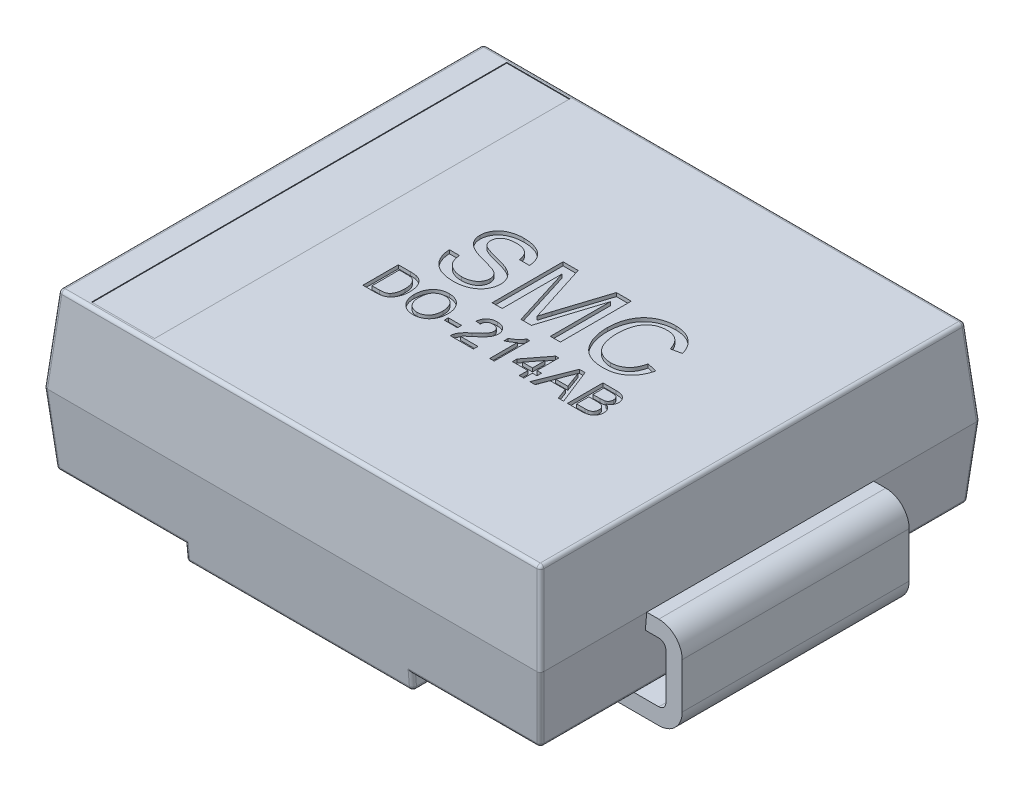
from build123d import *

# Parameters (mm, degrees)
BOSS_EXTRUDE1_START = 1.3
SKETCH1_W           = 7
SKETCH1_H           = 6.2
BOSS_EXTRUDE1_DEPTH = 1.2
BOSS_EXTRUDE1_TAPER = 5
BOSS_EXTRUDE2_START = 1.3
SKETCH1_2_W         = 7
SKETCH1_2_H         = 6.2
BOSS_EXTRUDE2_DEPTH = 1.23
BOSS_EXTRUDE2_DRAFT = -5
CUT_EXTRUDE2_DEPTH  = 4
BOSS_EXTRUDE3_DEPTH = 1.6
FILLET1_R           = 0.05
SKETCH5_W           = 0.890323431
SKETCH5_H           = 5.855004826
CUT_EXTRUDE4_DEPTH  = 0.01
SKETCH4_W           = 0.185897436
SKETCH4_H           = 0.057692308
CUT_EXTRUDE3_DEPTH  = 0.05


with BuildPart() as part:
    # Sketch1 → Boss-Extrude1 (new body)
    with BuildSketch(Plane(origin=(0, 0, 0), x_dir=(1, 0, 0), z_dir=(0, 1, 0)).offset(BOSS_EXTRUDE1_START)):
        Rectangle(SKETCH1_W, SKETCH1_H)
    extrude(amount=BOSS_EXTRUDE1_DEPTH, taper=BOSS_EXTRUDE1_TAPER)


with BuildPart() as boss_extrude2_tool:
    # Sketch1_2 → Boss-Extrude2 (with draft: the straight prism first)
    with BuildSketch(Plane(origin=(0, 0, 0), x_dir=(1, 0, 0), z_dir=(0, 1, 0)).offset(BOSS_EXTRUDE2_START)):
        Rectangle(SKETCH1_2_W, SKETCH1_2_H)
    extrude(amount=-BOSS_EXTRUDE2_DEPTH)
    # Boss-Extrude2: the draft: its side faces are tilted about the plane it starts from
    boss_extrude2_sides = [boss_extrude2_tool.faces().sort_by_distance(p)[0] for p in [
        (0, 0.685, 3.1),
        (3.5, 0.685, 0),
        (0, 0.685, -3.1),
        (-3.5, 0.685, 0),
    ]]
    draft(boss_extrude2_sides, Plane(origin=(0, 0, 0), x_dir=(1, 0, 0), z_dir=(0, 1, 0)).offset(BOSS_EXTRUDE2_START), BOSS_EXTRUDE2_DRAFT)


with BuildPart() as part_1:
    add(part.part)

    # Boss-Extrude2: add boss_extrude2_tool
    add(boss_extrude2_tool.part)

    # Sketch3 → Cut-Extrude2 (cut, symmetric)
    with BuildSketch(Plane.XY):
        Polygon((1.6, 0), (-1.6, 0), (-1.6, 0.297017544), (-3.60877193, 0.297017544), (-3.60877193, -0.205171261), (3.60877193, -0.205171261), (3.60877193, 0.297017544), (1.6, 0.297017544), align=None)
    extrude(amount=CUT_EXTRUDE2_DEPTH, both=True, mode=Mode.SUBTRACT)

    # Sketch2 → Boss-Extrude3 (add, symmetric)
    with BuildSketch(Plane.XY):
        with BuildLine():
            Line((3.67, 1.3), (-3.67, 1.3))
            ThreePointArc((-3.67, 1.3), (-3.903345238, 1.203345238), (-4, 0.97))
            Line((-4, 0.97), (-4, 0.33))
            ThreePointArc((-4, 0.33), (-3.903345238, 0.096654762), (-3.67, 0))
            Line((-3.67, 0), (-2.5, 0))
            Line((-2.5, 0), (-2.5, 0.23))
            Line((-2.5, 0.23), (-3.67, 0.23))
            ThreePointArc((-3.67, 0.23), (-3.740710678, 0.259289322), (-3.77, 0.33))
            Line((-3.77, 0.33), (-3.77, 0.97))
            ThreePointArc((-3.77, 0.97), (-3.740710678, 1.040710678), (-3.67, 1.07))
            Line((-3.67, 1.07), (3.67, 1.07))
            ThreePointArc((3.67, 1.07), (3.740710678, 1.040710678), (3.77, 0.97))
            Line((3.77, 0.97), (3.77, 0.33))
            ThreePointArc((3.77, 0.33), (3.740710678, 0.259289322), (3.67, 0.23))
            Line((3.67, 0.23), (2.5, 0.23))
            Line((2.5, 0.23), (2.5, 0))
            Line((2.5, 0), (3.67, 0))
            ThreePointArc((3.67, 0), (3.903345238, 0.096654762), (4, 0.33))
            Line((4, 0.33), (4, 0.97))
            ThreePointArc((4, 0.97), (3.903345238, 1.203345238), (3.67, 1.3))
        make_face()
    extrude(amount=BOSS_EXTRUDE3_DEPTH, both=True)

    # Fillet1
    fillet1_edges = [part_1.edges().sort_by_distance(p)[0] for p in [
        (-3.395013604, 2.5, 0),
        (0, 2.5, 2.995013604),
        (0, 0.07, 2.992388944),
        (0, 0.07, -2.992388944),
        (1.6, 0.07, 0),
        (-1.6, 0.07, 0),
        (3.456125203, 0.798508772, -3.056125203),
        (-3.456125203, 0.798508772, -3.056125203),
        (-2.506125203, 0.297017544, -3.012250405),
        (2.506125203, 0.297017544, -3.012250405),
        (-3.456125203, 0.798508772, 3.056125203),
        (3.456125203, 0.798508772, 3.056125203),
        (3.412250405, 0.297017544, 0),
        (2.506125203, 0.297017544, 3.012250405),
        (-2.506125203, 0.297017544, 3.012250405),
        (-3.412250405, 0.297017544, 0),
        (-1.6, 0.183508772, 3.002319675),
        (-1.6, 0.183508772, -3.002319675),
        (1.6, 0.183508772, 3.002319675),
        (1.6, 0.183508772, -3.002319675),
        (3.395013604, 2.5, 0),
        (0, 2.5, -2.995013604),
        (3.447506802, 1.9, 3.047506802),
        (-3.447506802, 1.9, 3.047506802),
        (-3.447506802, 1.9, -3.047506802),
        (3.447506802, 1.9, -3.047506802),
    ]]
    fillet(fillet1_edges, radius=FILLET1_R)

    # Sketch5 → Cut-Extrude4 (cut)
    with BuildSketch(Plane(origin=(0, 2.5, 0), x_dir=(1, 0, 0), z_dir=(0, 1, 0))):
        with Locations((-2.556330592, 0)):
            Rectangle(SKETCH5_W, SKETCH5_H)
    extrude(amount=-CUT_EXTRUDE4_DEPTH, mode=Mode.SUBTRACT)

    # Sketch4 → Cut-Extrude3 (cut)
    # profile 1 of 11: a face of its own
    with BuildSketch(Plane(origin=(0, 2.5, 0), x_dir=(1, 0, 0), z_dir=(0, 1, 0))):
        with BuildLine():
            Line((-1.117518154, 0.235376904), (-0.976492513, 0.235376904))
            add(Edge.make_bspline(
                [(-0.976492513, 0.235376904), (-0.974941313, 0.22271474), (-0.971961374, 0.198390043), (-0.963629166, 0.163913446), (-0.952905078, 0.132915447), (-0.939543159, 0.104984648), (-0.921966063, 0.080455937), (-0.900788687, 0.058331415), (-0.875069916, 0.039172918), (-0.846039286, 0.022123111), (-0.813707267, 0.008736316), (-0.779189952, -0.001187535), (-0.74265196, -0.007067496), (-0.717632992, -0.007825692), (-0.704857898, -0.00821284)],
                knots=[0, 0, 0, 0, 1.125557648, 2.162256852, 3.1243583, 4.018160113, 4.88511607, 5.777380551, 6.711250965, 7.707237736, 8.743031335, 9.791730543, 10.872421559, 12, 12, 12, 12], degree=3))
            add(Edge.make_bspline(
                [(-0.704857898, -0.00821284), (-0.69355304, -0.008003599), (-0.671510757, -0.00759562), (-0.63962413, -0.002694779), (-0.609618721, 0.004256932), (-0.582052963, 0.014772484), (-0.557028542, 0.02754166), (-0.535297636, 0.042986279), (-0.516744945, 0.060403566), (-0.502216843, 0.080252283), (-0.490803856, 0.101050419), (-0.48243125, 0.122428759), (-0.47744386, 0.144268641), (-0.476808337, 0.15896364), (-0.476492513, 0.166266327)],
                knots=[0, 0, 0, 0, 1.267006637, 2.470417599, 3.611360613, 4.716023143, 5.771382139, 6.754486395, 7.697536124, 8.612899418, 9.501261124, 10.352596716, 11.181322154, 12, 12, 12, 12], degree=3))
            add(Edge.make_bspline(
                [(-0.476492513, 0.166266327), (-0.476830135, 0.173495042), (-0.477490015, 0.187623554), (-0.481790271, 0.208192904), (-0.489963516, 0.227019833), (-0.500569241, 0.24487277), (-0.515323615, 0.261195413), (-0.533964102, 0.276235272), (-0.556901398, 0.289870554), (-0.574020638, 0.29733803), (-0.583063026, 0.301282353)],
                knots=[0, 0, 0, 0, 0.942140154, 1.841411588, 2.718743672, 3.605002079, 4.535543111, 5.568170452, 6.715506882, 8, 8, 8, 8], degree=3))
            add(Edge.make_bspline(
                [(-0.583063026, 0.301282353), (-0.586586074, 0.302728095), (-0.59454528, 0.305994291), (-0.608186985, 0.310318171), (-0.624374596, 0.315909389), (-0.643497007, 0.321667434), (-0.665451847, 0.327758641), (-0.690202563, 0.334652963), (-0.717735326, 0.341984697), (-0.747269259, 0.349788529), (-0.777089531, 0.35772383), (-0.805579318, 0.365666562), (-0.831791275, 0.373729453), (-0.855940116, 0.381492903), (-0.877901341, 0.389288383), (-0.897737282, 0.396902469), (-0.915472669, 0.404180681), (-0.926304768, 0.409532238), (-0.931420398, 0.412059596)],
                knots=[0, 0, 0, 0, 0.499201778, 1.127787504, 1.87543728, 2.745208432, 3.745951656, 4.863402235, 6.114490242, 7.482339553, 8.869366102, 10.161191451, 11.360587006, 12.46547846, 13.487450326, 14.41601931, 15.251940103, 16, 16, 16, 16], degree=3))
            add(Edge.make_bspline(
                [(-0.931420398, 0.412059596), (-0.943190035, 0.418417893), (-0.965908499, 0.430691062), (-0.996485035, 0.452635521), (-1.02224887, 0.476986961), (-1.043091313, 0.503710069), (-1.059424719, 0.532352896), (-1.070444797, 0.562964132), (-1.077992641, 0.594988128), (-1.078698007, 0.617009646), (-1.079056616, 0.628205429)],
                knots=[0, 0, 0, 0, 1.158441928, 2.236094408, 3.251151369, 4.220012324, 5.163146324, 6.095083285, 7.031536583, 8, 8, 8, 8], degree=3))
            add(Edge.make_bspline(
                [(-1.079056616, 0.628205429), (-1.07858067, 0.640602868), (-1.077634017, 0.665261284), (-1.069236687, 0.701445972), (-1.055842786, 0.736265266), (-1.040596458, 0.763908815), (-1.025727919, 0.784812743), (-1.013401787, 0.79986737), (-0.99957562, 0.813783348), (-0.984675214, 0.826754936), (-0.968434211, 0.838588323), (-0.951255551, 0.849769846), (-0.932517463, 0.859380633), (-0.906187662, 0.871612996), (-0.870964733, 0.883828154), (-0.826623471, 0.894472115), (-0.779955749, 0.900740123), (-0.748145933, 0.901602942), (-0.731901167, 0.90204357)],
                knots=[0, 0, 0, 0, 1.199927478, 2.386647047, 3.578628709, 4.806592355, 5.433127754, 6.062729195, 6.689531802, 7.331674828, 7.974827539, 8.635320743, 9.315455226, 10.01318112, 11.447700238, 12.918145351, 14.426146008, 16, 16, 16, 16], degree=3))
            add(Edge.make_bspline(
                [(-0.731901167, 0.90204357), (-0.714120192, 0.901636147), (-0.679497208, 0.900842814), (-0.629189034, 0.894242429), (-0.58226528, 0.882907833), (-0.545466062, 0.870219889), (-0.51826083, 0.857375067), (-0.498933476, 0.847352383), (-0.480993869, 0.835764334), (-0.464280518, 0.823224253), (-0.448638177, 0.809737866), (-0.43446889, 0.794984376), (-0.421157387, 0.779467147), (-0.405514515, 0.757189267), (-0.388648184, 0.727704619), (-0.374064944, 0.689506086), (-0.364046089, 0.649190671), (-0.362097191, 0.621319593), (-0.361107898, 0.607171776)],
                knots=[0, 0, 0, 0, 1.607600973, 3.130308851, 4.577334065, 5.967726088, 6.640410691, 7.296826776, 7.935019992, 8.569057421, 9.185393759, 9.8003086, 10.417295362, 11.032210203, 12.259799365, 13.477607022, 14.719591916, 16, 16, 16, 16], degree=3))
            Line((-0.361107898, 0.607171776), (-0.502133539, 0.607171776))
            add(Edge.make_bspline(
                [(-0.502133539, 0.607171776), (-0.503029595, 0.614332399), (-0.504782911, 0.628343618), (-0.509132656, 0.648626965), (-0.515230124, 0.667465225), (-0.522372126, 0.685034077), (-0.531029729, 0.701150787), (-0.541121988, 0.715970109), (-0.552771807, 0.729317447), (-0.565679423, 0.741545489), (-0.580237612, 0.7521927), (-0.59637157, 0.761434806), (-0.614108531, 0.769242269), (-0.63343287, 0.775636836), (-0.654348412, 0.780594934), (-0.67690273, 0.784242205), (-0.701087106, 0.786110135), (-0.717742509, 0.786472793), (-0.726292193, 0.786658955)],
                knots=[0, 0, 0, 0, 1.074487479, 2.102453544, 3.083708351, 4.020042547, 4.923259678, 5.803182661, 6.684453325, 7.556870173, 8.445961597, 9.363679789, 10.320905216, 11.327237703, 12.390948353, 13.519046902, 14.726457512, 16, 16, 16, 16], degree=3))
            add(Edge.make_bspline(
                [(-0.726292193, 0.786658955), (-0.73517919, 0.786591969), (-0.752382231, 0.786462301), (-0.777251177, 0.784098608), (-0.800301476, 0.780855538), (-0.821493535, 0.776071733), (-0.840757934, 0.769809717), (-0.858380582, 0.762578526), (-0.873868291, 0.753414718), (-0.887582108, 0.743207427), (-0.899412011, 0.731913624), (-0.909607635, 0.720012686), (-0.918624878, 0.707854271), (-0.925631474, 0.694773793), (-0.931335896, 0.681266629), (-0.935015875, 0.667078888), (-0.937621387, 0.652473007), (-0.937892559, 0.642507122), (-0.938030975, 0.637420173)],
                knots=[0, 0, 0, 0, 1.464176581, 2.834285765, 4.113735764, 5.29917439, 6.409476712, 7.449999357, 8.431575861, 9.367089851, 10.262376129, 11.120706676, 11.948504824, 12.751342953, 13.560717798, 14.359016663, 15.162382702, 16, 16, 16, 16], degree=3))
            add(Edge.make_bspline(
                [(-0.938030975, 0.637420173), (-0.937666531, 0.628816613), (-0.93695918, 0.612117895), (-0.929736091, 0.588394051), (-0.918626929, 0.56676823), (-0.907682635, 0.555001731), (-0.902173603, 0.549078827)],
                knots=[0, 0, 0, 0, 1.050964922, 2.039826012, 3.013306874, 4, 4, 4, 4], degree=3))
            add(Edge.make_bspline(
                [(-0.902173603, 0.549078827), (-0.898700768, 0.546118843), (-0.891020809, 0.53957302), (-0.87673106, 0.53091039), (-0.859013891, 0.522157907), (-0.837750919, 0.513457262), (-0.812978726, 0.504702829), (-0.784737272, 0.495689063), (-0.752918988, 0.486736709), (-0.718493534, 0.478109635), (-0.683715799, 0.469447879), (-0.650665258, 0.460819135), (-0.620319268, 0.452641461), (-0.592725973, 0.444665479), (-0.567856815, 0.436913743), (-0.545798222, 0.429223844), (-0.526371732, 0.422151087), (-0.514470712, 0.417174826), (-0.508944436, 0.414864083)],
                knots=[0, 0, 0, 0, 0.523891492, 1.158553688, 1.913783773, 2.794766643, 3.797521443, 4.933638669, 6.202080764, 7.596537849, 9.013317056, 10.322179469, 11.523240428, 12.626146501, 13.623953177, 14.517289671, 15.311498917, 16, 16, 16, 16], degree=3))
            add(Edge.make_bspline(
                [(-0.508944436, 0.414864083), (-0.501754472, 0.411549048), (-0.487641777, 0.405042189), (-0.467649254, 0.393932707), (-0.448994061, 0.382396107), (-0.43182692, 0.370121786), (-0.41620334, 0.357083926), (-0.401948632, 0.34343191), (-0.388976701, 0.329242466), (-0.377810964, 0.31406145), (-0.367785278, 0.298502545), (-0.359012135, 0.282348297), (-0.351948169, 0.265503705), (-0.34575263, 0.248171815), (-0.341296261, 0.230159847), (-0.337801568, 0.211649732), (-0.335763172, 0.192554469), (-0.335566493, 0.179625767), (-0.335466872, 0.173077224)],
                knots=[0, 0, 0, 0, 1.198900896, 2.353241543, 3.461831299, 4.520043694, 5.547003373, 6.541368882, 7.508191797, 8.454912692, 9.392021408, 10.310662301, 11.235020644, 12.156274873, 13.095836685, 14.042125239, 15.00831306, 16, 16, 16, 16], degree=3))
            add(Edge.make_bspline(
                [(-0.335466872, 0.173077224), (-0.335988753, 0.160008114), (-0.337024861, 0.134061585), (-0.345946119, 0.095815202), (-0.359960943, 0.058754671), (-0.376396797, 0.029345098), (-0.391933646, 0.006880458), (-0.404985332, -0.009266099), (-0.419458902, -0.024196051), (-0.43499803, -0.038377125), (-0.451723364, -0.051519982), (-0.469775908, -0.063629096), (-0.488965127, -0.074830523), (-0.516366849, -0.088480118), (-0.552760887, -0.10275889), (-0.599119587, -0.114649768), (-0.647976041, -0.122363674), (-0.681523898, -0.123180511), (-0.698647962, -0.123597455)],
                knots=[0, 0, 0, 0, 1.197055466, 2.376552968, 3.581957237, 4.820753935, 5.454298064, 6.085440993, 6.72202542, 7.359198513, 8.013298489, 8.67051481, 9.351020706, 10.049282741, 11.476266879, 12.925760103, 14.430794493, 16, 16, 16, 16], degree=3))
            add(Edge.make_bspline(
                [(-0.698647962, -0.123597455), (-0.709535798, -0.123507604), (-0.730863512, -0.123331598), (-0.762202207, -0.121200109), (-0.79223465, -0.118116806), (-0.820931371, -0.113524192), (-0.848202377, -0.107498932), (-0.874145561, -0.100263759), (-0.898822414, -0.091930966), (-0.922146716, -0.082131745), (-0.944057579, -0.070746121), (-0.964948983, -0.058463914), (-0.984479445, -0.044541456), (-1.002690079, -0.029197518), (-1.020042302, -0.012875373), (-1.035816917, 0.005091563), (-1.050550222, 0.024177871), (-1.063905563, 0.044558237), (-1.075836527, 0.065966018), (-1.086565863, 0.088041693), (-1.095605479, 0.110945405), (-1.102890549, 0.134561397), (-1.109061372, 0.158731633), (-1.113340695, 0.18365777), (-1.116486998, 0.209261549), (-1.117172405, 0.226620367), (-1.117518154, 0.235376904)],
                knots=[0, 0, 0, 0, 1.259822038, 2.467811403, 3.633536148, 4.752793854, 5.829021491, 6.863980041, 7.868367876, 8.841470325, 9.788447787, 10.724101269, 11.643985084, 12.560193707, 13.478453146, 14.398077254, 15.323914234, 16.266973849, 17.21495974, 18.158525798, 19.105629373, 20.061269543, 21.017128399, 21.990322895, 22.986232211, 24, 24, 24, 24], degree=3))
        make_face()
    # profile 2 of 11: a face of its own
    with BuildSketch(Plane(origin=(0, 2.5, 0), x_dir=(1, 0, 0), z_dir=(0, 1, 0))):
        with BuildLine():
            Line((-0.168800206, -0.110776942), (-0.168800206, 0.889223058))
            Line((-0.168800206, 0.889223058), (0.043339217, 0.889223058))
            Line((0.043339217, 0.889223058), (0.26689691, 0.187500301))
            add(Edge.make_bspline(
                [(0.26689691, 0.187500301), (0.269357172, 0.179551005), (0.274115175, 0.16417753), (0.281170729, 0.141976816), (0.287590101, 0.12134623), (0.293371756, 0.102220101), (0.298827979, 0.084693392), (0.303552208, 0.068622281), (0.308068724, 0.054185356), (0.310715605, 0.045010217), (0.311969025, 0.040665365)],
                knots=[0, 0, 0, 0, 1.300204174, 2.514519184, 3.639827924, 4.676153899, 5.636536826, 6.507959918, 7.293450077, 8, 8, 8, 8], degree=3))
            add(Edge.make_bspline(
                [(0.311969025, 0.040665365), (0.313365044, 0.045408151), (0.316335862, 0.055501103), (0.321152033, 0.071370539), (0.326276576, 0.088931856), (0.332409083, 0.107883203), (0.338801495, 0.128521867), (0.345511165, 0.15083071), (0.353250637, 0.174587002), (0.358393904, 0.191033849), (0.361047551, 0.199519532)],
                knots=[0, 0, 0, 0, 0.713638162, 1.518667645, 2.393860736, 3.354087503, 4.393659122, 5.512594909, 6.716633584, 8, 8, 8, 8], degree=3))
            Line((0.361047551, 0.199519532), (0.582401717, 0.889223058))
            Line((0.582401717, 0.889223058), (0.792738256, 0.889223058))
            Line((0.792738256, 0.889223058), (0.792738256, -0.110776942))
            Line((0.792738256, -0.110776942), (0.651712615, -0.110776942))
            Line((0.651712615, -0.110776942), (0.651712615, 0.735376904))
            Line((0.651712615, 0.735376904), (0.384885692, -0.110776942))
            Line((0.384885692, -0.110776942), (0.237449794, -0.110776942))
            Line((0.237449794, -0.110776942), (-0.027774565, 0.735376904))
            Line((-0.027774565, 0.735376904), (-0.027774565, -0.110776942))
            Line((-0.027774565, -0.110776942), (-0.168800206, -0.110776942))
        make_face()
    # profile 3 of 11: a face of its own
    with BuildSketch(Plane(origin=(0, 2.5, 0), x_dir=(1, 0, 0), z_dir=(0, 1, 0))):
        with BuildLine():
            Line((1.677353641, 0.242187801), (1.818379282, 0.209335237))
            add(Edge.make_bspline(
                [(1.818379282, 0.209335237), (1.814846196, 0.196117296), (1.807935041, 0.170261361), (1.794270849, 0.133258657), (1.778934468, 0.098533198), (1.761553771, 0.066176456), (1.741938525, 0.036374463), (1.720608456, 0.008744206), (1.696718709, -0.016134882), (1.671145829, -0.038836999), (1.643690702, -0.058860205), (1.614684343, -0.076150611), (1.584266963, -0.090861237), (1.552315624, -0.102958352), (1.518809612, -0.112062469), (1.483921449, -0.118698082), (1.447549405, -0.122785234), (1.422756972, -0.123323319), (1.410126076, -0.123597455)],
                knots=[0, 0, 0, 0, 1.145254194, 2.240259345, 3.299159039, 4.322497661, 5.312016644, 6.284080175, 7.241264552, 8.196044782, 9.144516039, 10.082428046, 11.020306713, 11.970622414, 12.939253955, 13.924100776, 14.94240044, 16, 16, 16, 16], degree=3))
            add(Edge.make_bspline(
                [(1.410126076, -0.123597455), (1.397166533, -0.123409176), (1.371812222, -0.123040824), (1.334669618, -0.120044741), (1.299343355, -0.114848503), (1.265899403, -0.107629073), (1.234225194, -0.098702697), (1.204452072, -0.087472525), (1.176632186, -0.074019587), (1.150533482, -0.05872012), (1.126266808, -0.041339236), (1.103280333, -0.022345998), (1.082132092, -0.001217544), (1.062293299, 0.021547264), (1.04419605, 0.046248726), (1.027174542, 0.072551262), (1.012059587, 0.100918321), (0.998291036, 0.130823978), (0.986206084, 0.161978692), (0.975515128, 0.193767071), (0.966774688, 0.226252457), (0.959249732, 0.259161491), (0.953783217, 0.29277108), (0.949442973, 0.32682905), (0.94705662, 0.361544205), (0.946742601, 0.384879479), (0.94658441, 0.396634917)],
                knots=[0, 0, 0, 0, 1.180702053, 2.309949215, 3.392367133, 4.431746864, 5.425408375, 6.388154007, 7.326956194, 8.237882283, 9.141054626, 10.043899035, 10.951650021, 11.86168169, 12.792564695, 13.739356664, 14.713891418, 15.718426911, 16.737522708, 17.757217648, 18.772674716, 19.801476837, 20.831699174, 21.873853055, 22.928926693, 24, 24, 24, 24], degree=3))
            add(Edge.make_bspline(
                [(0.94658441, 0.396634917), (0.946810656, 0.409325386), (0.947257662, 0.434398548), (0.949781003, 0.471394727), (0.954415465, 0.507100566), (0.960851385, 0.54153955), (0.968995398, 0.574739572), (0.97904827, 0.606716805), (0.990882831, 0.637430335), (1.004463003, 0.666914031), (1.019879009, 0.694838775), (1.036670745, 0.721244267), (1.055238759, 0.745696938), (1.075032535, 0.768663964), (1.096546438, 0.789762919), (1.119714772, 0.809041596), (1.144337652, 0.826675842), (1.170411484, 0.842501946), (1.197595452, 0.856388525), (1.225485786, 0.868757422), (1.254193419, 0.878895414), (1.283490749, 0.887324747), (1.313440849, 0.894035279), (1.344113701, 0.898522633), (1.375480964, 0.90144694), (1.396631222, 0.901843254), (1.407321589, 0.90204357)],
                knots=[0, 0, 0, 0, 1.185634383, 2.342514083, 3.462112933, 4.547331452, 5.613960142, 6.653690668, 7.676612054, 8.686959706, 9.683658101, 10.654407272, 11.607580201, 12.5494388, 13.484601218, 14.419076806, 15.362504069, 16.311442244, 17.265594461, 18.212500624, 19.159571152, 20.107257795, 21.059246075, 22.024387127, 23.001429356, 24, 24, 24, 24], degree=3))
            add(Edge.make_bspline(
                [(1.407321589, 0.90204357), (1.41928267, 0.90181811), (1.442793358, 0.901374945), (1.477291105, 0.897729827), (1.510330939, 0.891624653), (1.542056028, 0.883615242), (1.572136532, 0.872648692), (1.600899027, 0.859610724), (1.628057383, 0.843947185), (1.653822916, 0.826088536), (1.677776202, 0.806001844), (1.700252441, 0.784166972), (1.720335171, 0.76003821), (1.738819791, 0.734199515), (1.755124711, 0.706292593), (1.769849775, 0.676560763), (1.782512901, 0.644783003), (1.789288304, 0.622648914), (1.792738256, 0.611378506)],
                knots=[0, 0, 0, 0, 1.098391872, 2.158997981, 3.181470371, 4.182549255, 5.160268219, 6.118029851, 7.079534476, 8.035645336, 8.993622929, 9.94770573, 10.909620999, 11.872786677, 12.862530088, 13.874594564, 14.917769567, 16, 16, 16, 16], degree=3))
            Line((1.792738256, 0.611378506), (1.651712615, 0.581130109))
            add(Edge.make_bspline(
                [(1.651712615, 0.581130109), (1.648943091, 0.589779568), (1.643522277, 0.606709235), (1.633897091, 0.63083702), (1.623502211, 0.653235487), (1.612090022, 0.673752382), (1.599635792, 0.692392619), (1.586426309, 0.709382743), (1.572145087, 0.72440563), (1.557082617, 0.737807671), (1.540849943, 0.749224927), (1.523827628, 0.759342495), (1.505656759, 0.767713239), (1.486598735, 0.77479316), (1.466475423, 0.780181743), (1.445368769, 0.783972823), (1.423260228, 0.786166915), (1.408194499, 0.786492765), (1.400510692, 0.786658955)],
                knots=[0, 0, 0, 0, 1.235697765, 2.418642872, 3.532555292, 4.594392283, 5.610119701, 6.580908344, 7.519430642, 8.427315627, 9.319973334, 10.216139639, 11.118687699, 12.038725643, 12.980015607, 13.949697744, 14.954307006, 16, 16, 16, 16], degree=3))
            add(Edge.make_bspline(
                [(1.400510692, 0.786658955), (1.391688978, 0.786530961), (1.374339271, 0.786279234), (1.348850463, 0.783524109), (1.324372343, 0.77946608), (1.301087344, 0.773380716), (1.278868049, 0.76579385), (1.257846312, 0.756346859), (1.237843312, 0.745273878), (1.219082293, 0.732508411), (1.201720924, 0.71815757), (1.185288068, 0.702986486), (1.170572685, 0.686287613), (1.157013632, 0.668611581), (1.14500575, 0.64964604), (1.134196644, 0.629649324), (1.124655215, 0.608457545), (1.114254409, 0.578631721), (1.103649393, 0.540216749), (1.094449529, 0.493209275), (1.088589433, 0.445461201), (1.087937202, 0.413344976), (1.087610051, 0.397235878)],
                knots=[0, 0, 0, 0, 0.935256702, 1.839373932, 2.716087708, 3.564631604, 4.388828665, 5.203538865, 6.005592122, 6.810952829, 7.606223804, 8.392839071, 9.180346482, 9.963639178, 10.753404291, 11.558266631, 12.372976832, 13.215232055, 14.905983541, 16.594894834, 18.292041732, 20, 20, 20, 20], degree=3))
            add(Edge.make_bspline(
                [(1.087610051, 0.397235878), (1.087979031, 0.376981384), (1.088694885, 0.33768583), (1.095758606, 0.280740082), (1.106528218, 0.227625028), (1.119525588, 0.186184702), (1.132563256, 0.155617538), (1.143107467, 0.134210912), (1.155143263, 0.114402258), (1.16837127, 0.096079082), (1.182961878, 0.079294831), (1.198711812, 0.063960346), (1.215624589, 0.049928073), (1.233900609, 0.037854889), (1.252836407, 0.027134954), (1.272193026, 0.017602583), (1.291982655, 0.009540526), (1.312285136, 0.003277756), (1.332815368, -0.002134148), (1.353799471, -0.005669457), (1.37523146, -0.007664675), (1.38962251, -0.008028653), (1.396904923, -0.00821284)],
                knots=[0, 0, 0, 0, 2.10686522, 4.087509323, 5.961373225, 7.741398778, 8.594514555, 9.418024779, 10.222433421, 11.003575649, 11.767087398, 12.533660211, 13.289033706, 14.050297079, 14.809623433, 15.552362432, 16.294320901, 17.0305302, 17.761969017, 18.502233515, 19.242073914, 20, 20, 20, 20], degree=3))
            add(Edge.make_bspline(
                [(1.396904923, -0.00821284), (1.405595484, -0.00803058), (1.422762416, -0.007670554), (1.447931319, -0.00451922), (1.472193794, 0.000124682), (1.495255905, 0.007290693), (1.517427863, 0.016064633), (1.538528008, 0.026884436), (1.558489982, 0.039897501), (1.577548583, 0.054672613), (1.595352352, 0.071484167), (1.61166855, 0.090196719), (1.626306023, 0.110895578), (1.639878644, 0.133248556), (1.651282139, 0.157923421), (1.661844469, 0.184184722), (1.670645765, 0.212464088), (1.675085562, 0.232137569), (1.677353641, 0.242187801)],
                knots=[0, 0, 0, 0, 1.013374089, 2.001772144, 2.95501459, 3.891367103, 4.814208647, 5.733921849, 6.652182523, 7.590185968, 8.54346024, 9.504121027, 10.481158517, 11.497760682, 12.549996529, 13.647863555, 14.798406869, 16, 16, 16, 16], degree=3))
        make_face()
    # profile 4 of 11: a face of its own
    with BuildSketch(Plane(origin=(0, 2.5, 0), x_dir=(1, 0, 0), z_dir=(0, 1, 0))):
        with BuildLine():
            Line((-1.293786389, -0.808671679), (-1.293786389, -0.308671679))
            Line((-1.293786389, -0.308671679), (-1.122812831, -0.308671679))
            add(Edge.make_bspline(
                [(-1.122812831, -0.308671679), (-1.118138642, -0.308692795), (-1.109056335, -0.308733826), (-1.095863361, -0.30899533), (-1.083509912, -0.309626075), (-1.072052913, -0.310394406), (-1.06143458, -0.311417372), (-1.051668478, -0.312561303), (-1.042746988, -0.314053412), (-1.03713795, -0.315293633), (-1.034471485, -0.315883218)],
                knots=[0, 0, 0, 0, 1.263127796, 2.454354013, 3.565393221, 4.605443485, 5.557051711, 6.447822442, 7.26211484, 8, 8, 8, 8], degree=3))
            add(Edge.make_bspline(
                [(-1.034471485, -0.315883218), (-1.027575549, -0.317692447), (-1.014027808, -0.321246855), (-0.994903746, -0.329242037), (-0.977347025, -0.339270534), (-0.966934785, -0.347531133), (-0.961755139, -0.351640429)],
                knots=[0, 0, 0, 0, 1.04477941, 2.052571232, 3.03123721, 4, 4, 4, 4], degree=3))
            add(Edge.make_bspline(
                [(-0.961755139, -0.351640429), (-0.958539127, -0.35446461), (-0.952092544, -0.360125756), (-0.943238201, -0.369452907), (-0.935024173, -0.379347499), (-0.927205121, -0.389639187), (-0.920281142, -0.40070318), (-0.913790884, -0.412221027), (-0.908129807, -0.424424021), (-0.902918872, -0.43711273), (-0.898276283, -0.45033661), (-0.89446163, -0.464087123), (-0.890957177, -0.47822068), (-0.888350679, -0.492891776), (-0.88607534, -0.50797597), (-0.884630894, -0.523559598), (-0.883693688, -0.539596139), (-0.88358508, -0.550457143), (-0.883529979, -0.555967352)],
                knots=[0, 0, 0, 0, 0.908997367, 1.822109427, 2.728529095, 3.640759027, 4.565643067, 5.499218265, 6.448003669, 7.421473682, 8.413047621, 9.423472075, 10.452328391, 11.505545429, 12.587978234, 13.692612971, 14.829372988, 16, 16, 16, 16], degree=3))
            add(Edge.make_bspline(
                [(-0.883529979, -0.555967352), (-0.88366429, -0.565188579), (-0.883925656, -0.58313287), (-0.886510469, -0.609232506), (-0.890510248, -0.63376531), (-0.896331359, -0.656583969), (-0.903500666, -0.677561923), (-0.911321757, -0.696870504), (-0.920324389, -0.714177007), (-0.930200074, -0.729627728), (-0.940781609, -0.743320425), (-0.951867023, -0.755460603), (-0.963489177, -0.766053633), (-0.975589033, -0.775377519), (-0.988795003, -0.783097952), (-1.002968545, -0.790030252), (-1.018569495, -0.795600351), (-1.035304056, -0.800472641), (-1.053368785, -0.804122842), (-1.072665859, -0.806805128), (-1.093271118, -0.80842714), (-1.107418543, -0.808588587), (-1.114699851, -0.808671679)],
                knots=[0, 0, 0, 0, 1.410753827, 2.745293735, 4.009435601, 5.211453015, 6.344066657, 7.400119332, 8.396481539, 9.324811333, 10.202671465, 11.041621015, 11.837259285, 12.606727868, 13.374311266, 14.17412185, 15.017911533, 15.905707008, 16.839601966, 17.835295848, 18.885883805, 20, 20, 20, 20], degree=3))
            Line((-1.114699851, -0.808671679), (-1.293786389, -0.808671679))
        make_face()
        with BuildLine():
            Line((-1.223273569, -0.750979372), (-1.120208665, -0.750979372))
            add(Edge.make_bspline(
                [(-1.120208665, -0.750979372), (-1.112693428, -0.750866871), (-1.098476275, -0.750654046), (-1.078418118, -0.749019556), (-1.060911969, -0.74620028), (-1.045763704, -0.742189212), (-1.032620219, -0.737002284), (-1.021047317, -0.730870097), (-1.010753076, -0.723911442), (-1.004954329, -0.718344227), (-1.002119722, -0.715622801)],
                knots=[0, 0, 0, 0, 1.423649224, 2.693227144, 3.808972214, 4.778671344, 5.656058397, 6.479437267, 7.256702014, 8, 8, 8, 8], degree=3))
            add(Edge.make_bspline(
                [(-1.002119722, -0.715622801), (-0.998431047, -0.71140508), (-0.99085324, -0.70274043), (-0.981416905, -0.687603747), (-0.973187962, -0.670572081), (-0.966309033, -0.651464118), (-0.960668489, -0.63034449), (-0.956906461, -0.607024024), (-0.954446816, -0.58166129), (-0.954180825, -0.564019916), (-0.954042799, -0.554865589)],
                knots=[0, 0, 0, 0, 0.782184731, 1.606876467, 2.483531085, 3.422528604, 4.441347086, 5.534669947, 6.720709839, 8, 8, 8, 8], degree=3))
            add(Edge.make_bspline(
                [(-0.954042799, -0.554865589), (-0.954128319, -0.548487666), (-0.954294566, -0.53608924), (-0.955330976, -0.518026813), (-0.957377, -0.501122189), (-0.959993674, -0.485346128), (-0.963566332, -0.470748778), (-0.967651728, -0.457190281), (-0.972791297, -0.444847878), (-0.978656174, -0.433626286), (-0.985090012, -0.423450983), (-0.991794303, -0.414103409), (-0.998803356, -0.405614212), (-1.006265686, -0.398104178), (-1.013956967, -0.391351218), (-1.022020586, -0.385493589), (-1.030433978, -0.380533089), (-1.036346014, -0.377958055), (-1.039279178, -0.376680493)],
                knots=[0, 0, 0, 0, 1.460126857, 2.838427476, 4.139102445, 5.35666337, 6.496721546, 7.577303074, 8.594995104, 9.55219858, 10.472533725, 11.348579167, 12.184287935, 12.989560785, 13.769667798, 14.524891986, 15.268148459, 16, 16, 16, 16], degree=3))
            add(Edge.make_bspline(
                [(-1.039279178, -0.376680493), (-1.041571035, -0.375841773), (-1.046427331, -0.374064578), (-1.054353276, -0.372053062), (-1.063198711, -0.370201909), (-1.073050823, -0.368902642), (-1.083859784, -0.367639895), (-1.095692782, -0.366872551), (-1.108487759, -0.36652481), (-1.117337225, -0.366418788), (-1.121911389, -0.366363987)],
                knots=[0, 0, 0, 0, 0.699400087, 1.48198292, 2.341906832, 3.289648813, 4.329964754, 5.462247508, 6.688271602, 8, 8, 8, 8], degree=3))
            Line((-1.121911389, -0.366363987), (-1.223273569, -0.366363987))
            Line((-1.223273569, -0.366363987), (-1.223273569, -0.750979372))
        make_face(mode=Mode.SUBTRACT)
    # profile 5 of 11: a face of its own
    with BuildSketch(Plane(origin=(0, 2.5, 0), x_dir=(1, 0, 0), z_dir=(0, 1, 0))):
        with BuildLine():
            add(Edge.make_bspline(
                [(-0.819427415, -0.565282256), (-0.819253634, -0.555257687), (-0.818915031, -0.535725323), (-0.815751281, -0.507283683), (-0.810614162, -0.480523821), (-0.803270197, -0.455447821), (-0.7939617, -0.432016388), (-0.782645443, -0.410176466), (-0.768981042, -0.390175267), (-0.753523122, -0.371822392), (-0.736257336, -0.355597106), (-0.71787418, -0.341186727), (-0.698144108, -0.329166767), (-0.67724941, -0.319242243), (-0.655101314, -0.311622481), (-0.631762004, -0.306287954), (-0.607256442, -0.302846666), (-0.590506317, -0.302459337), (-0.581947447, -0.302261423)],
                knots=[0, 0, 0, 0, 1.203621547, 2.345195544, 3.432004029, 4.472479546, 5.478447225, 6.455936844, 7.420185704, 8.381829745, 9.332027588, 10.260832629, 11.182364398, 12.100723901, 13.034044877, 13.989196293, 14.972532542, 16, 16, 16, 16], degree=3))
            add(Edge.make_bspline(
                [(-0.581947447, -0.302261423), (-0.576302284, -0.302359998), (-0.56509201, -0.30255575), (-0.548518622, -0.304045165), (-0.532371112, -0.306703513), (-0.51666538, -0.310265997), (-0.501358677, -0.314939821), (-0.48644186, -0.320457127), (-0.472045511, -0.327293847), (-0.458073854, -0.334948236), (-0.444691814, -0.34351), (-0.432115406, -0.352968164), (-0.420374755, -0.363251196), (-0.409312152, -0.37419007), (-0.399296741, -0.386153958), (-0.389914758, -0.398778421), (-0.381435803, -0.412287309), (-0.373829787, -0.426569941), (-0.367029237, -0.441405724), (-0.361216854, -0.456856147), (-0.356225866, -0.472735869), (-0.352047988, -0.489138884), (-0.349050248, -0.506059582), (-0.346663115, -0.523425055), (-0.345406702, -0.541292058), (-0.345182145, -0.553361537), (-0.34506844, -0.559472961)],
                knots=[0, 0, 0, 0, 1.034375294, 2.054082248, 3.045783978, 4.031219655, 5.002789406, 5.976610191, 6.94273282, 7.920236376, 8.894345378, 9.851183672, 10.800797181, 11.752517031, 12.698794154, 13.65688337, 14.632873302, 15.61821402, 16.620222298, 17.621258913, 18.640965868, 19.669244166, 20.720417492, 21.788124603, 22.880008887, 24, 24, 24, 24], degree=3))
            add(Edge.make_bspline(
                [(-0.34506844, -0.559472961), (-0.345172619, -0.565685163), (-0.345378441, -0.577958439), (-0.346771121, -0.596089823), (-0.349219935, -0.613700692), (-0.35246787, -0.63084356), (-0.356820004, -0.647482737), (-0.361991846, -0.66366593), (-0.368247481, -0.679296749), (-0.375312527, -0.694412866), (-0.383306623, -0.708806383), (-0.392124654, -0.722376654), (-0.401772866, -0.734996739), (-0.412104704, -0.746821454), (-0.423361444, -0.757639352), (-0.435404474, -0.767551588), (-0.44818749, -0.776651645), (-0.461753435, -0.784693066), (-0.475858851, -0.791741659), (-0.490224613, -0.79799503), (-0.504861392, -0.803328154), (-0.519819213, -0.807650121), (-0.535057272, -0.810916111), (-0.550532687, -0.813361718), (-0.566296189, -0.814769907), (-0.576903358, -0.814977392), (-0.582247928, -0.815081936)],
                knots=[0, 0, 0, 0, 1.141429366, 2.255090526, 3.338676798, 4.407031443, 5.458968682, 6.496860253, 7.526652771, 8.550250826, 9.560787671, 10.54935636, 11.521089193, 12.477323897, 13.431786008, 14.386110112, 15.340986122, 16.312041, 17.28047646, 18.236612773, 19.189437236, 20.140779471, 21.09494583, 22.051062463, 23.018000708, 24, 24, 24, 24], degree=3))
            add(Edge.make_bspline(
                [(-0.582247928, -0.815081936), (-0.587994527, -0.814996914), (-0.599377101, -0.814828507), (-0.616200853, -0.813147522), (-0.632606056, -0.810583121), (-0.648545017, -0.806880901), (-0.663995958, -0.802051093), (-0.678977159, -0.796205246), (-0.693541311, -0.789421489), (-0.707507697, -0.781505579), (-0.720828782, -0.772703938), (-0.733375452, -0.763060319), (-0.74514077, -0.752663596), (-0.75593595, -0.741341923), (-0.766110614, -0.729505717), (-0.775257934, -0.716715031), (-0.783676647, -0.703259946), (-0.791117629, -0.68901076), (-0.797839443, -0.674390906), (-0.803502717, -0.659395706), (-0.808479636, -0.64424615), (-0.812443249, -0.628848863), (-0.815601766, -0.613239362), (-0.81772564, -0.597443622), (-0.819259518, -0.581438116), (-0.819371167, -0.570694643), (-0.819427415, -0.565282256)],
                knots=[0, 0, 0, 0, 1.072727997, 2.12480551, 3.153819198, 4.171534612, 5.177148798, 6.173931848, 7.17235114, 8.174500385, 9.168706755, 10.151274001, 11.127173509, 12.097141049, 13.070188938, 14.039134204, 15.03036519, 16.031505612, 17.038625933, 18.033164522, 19.022845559, 20.014762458, 21.000193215, 21.994692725, 22.989758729, 24, 24, 24, 24], degree=3))
        make_face()
        with BuildLine():
            add(Edge.make_bspline(
                [(-0.748914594, -0.566083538), (-0.748806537, -0.573302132), (-0.748595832, -0.587377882), (-0.746185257, -0.607899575), (-0.742527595, -0.627262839), (-0.737485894, -0.645522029), (-0.730708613, -0.662496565), (-0.722605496, -0.678349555), (-0.712903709, -0.692975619), (-0.701817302, -0.706333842), (-0.689623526, -0.718333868), (-0.676593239, -0.728815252), (-0.662723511, -0.73759267), (-0.648168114, -0.744840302), (-0.632822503, -0.75049774), (-0.616732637, -0.75447025), (-0.599886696, -0.756954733), (-0.588399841, -0.757242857), (-0.582548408, -0.757389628)],
                knots=[0, 0, 0, 0, 1.215430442, 2.370003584, 3.475209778, 4.53279855, 5.55522989, 6.548792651, 7.526809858, 8.505409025, 9.467826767, 10.404123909, 11.316848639, 12.227335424, 13.138360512, 14.065900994, 15.014765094, 16, 16, 16, 16], degree=3))
            add(Edge.make_bspline(
                [(-0.582548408, -0.757389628), (-0.576597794, -0.757240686), (-0.564946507, -0.756949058), (-0.54784659, -0.754507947), (-0.531599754, -0.750352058), (-0.516044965, -0.74481963), (-0.501463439, -0.737340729), (-0.487514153, -0.728582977), (-0.474577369, -0.717881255), (-0.462335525, -0.705860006), (-0.451355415, -0.692195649), (-0.441612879, -0.677224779), (-0.433698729, -0.660722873), (-0.426865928, -0.643053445), (-0.421862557, -0.623882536), (-0.41816476, -0.60342808), (-0.415936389, -0.581624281), (-0.41570173, -0.566656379), (-0.415581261, -0.55897216)],
                knots=[0, 0, 0, 0, 0.976878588, 1.912725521, 2.8289017, 3.727303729, 4.617335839, 5.514666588, 6.426584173, 7.368641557, 8.327632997, 9.299405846, 10.294892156, 11.327373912, 12.405931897, 13.542618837, 14.738430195, 16, 16, 16, 16], degree=3))
            add(Edge.make_bspline(
                [(-0.415581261, -0.55897216), (-0.415623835, -0.554028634), (-0.415707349, -0.544331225), (-0.416813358, -0.530037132), (-0.418239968, -0.516187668), (-0.420412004, -0.502800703), (-0.423405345, -0.489931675), (-0.426721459, -0.477482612), (-0.430868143, -0.465560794), (-0.435573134, -0.454119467), (-0.440837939, -0.443217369), (-0.44677594, -0.43294641), (-0.453318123, -0.423346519), (-0.460287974, -0.414235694), (-0.468071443, -0.405966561), (-0.476293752, -0.398189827), (-0.485141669, -0.391066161), (-0.494526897, -0.384593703), (-0.504316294, -0.37876747), (-0.514489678, -0.373780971), (-0.524884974, -0.369400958), (-0.535676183, -0.366043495), (-0.5467143, -0.363335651), (-0.558043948, -0.361278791), (-0.569707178, -0.360213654), (-0.577571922, -0.360040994), (-0.581546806, -0.35995373)],
                knots=[0, 0, 0, 0, 1.220438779, 2.394059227, 3.538503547, 4.658058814, 5.74010225, 6.800155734, 7.837851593, 8.854470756, 9.853724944, 10.825214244, 11.781044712, 12.72106398, 13.654479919, 14.581868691, 15.514082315, 16.456304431, 17.39516604, 18.324312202, 19.252140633, 20.177768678, 21.111585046, 22.057694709, 23.018348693, 24, 24, 24, 24], degree=3))
            add(Edge.make_bspline(
                [(-0.581546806, -0.35995373), (-0.587164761, -0.360065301), (-0.598249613, -0.360285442), (-0.614567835, -0.362732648), (-0.63030037, -0.366389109), (-0.645471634, -0.371501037), (-0.659951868, -0.378270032), (-0.673816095, -0.386571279), (-0.687187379, -0.396178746), (-0.699854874, -0.407326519), (-0.71166375, -0.420132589), (-0.72164697, -0.435230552), (-0.7300611, -0.45225999), (-0.737086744, -0.471177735), (-0.742443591, -0.492130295), (-0.746145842, -0.515027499), (-0.748483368, -0.539893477), (-0.748767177, -0.557130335), (-0.748914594, -0.566083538)],
                knots=[0, 0, 0, 0, 0.895090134, 1.766112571, 2.624765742, 3.468151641, 4.313618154, 5.168136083, 6.041303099, 6.935189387, 7.854749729, 8.809996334, 9.809869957, 10.877771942, 12.021723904, 13.25217762, 14.572720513, 16, 16, 16, 16], degree=3))
        make_face(mode=Mode.SUBTRACT)
    # profile 6 of 11: a face of its own
    with BuildSketch(Plane(origin=(0, 2.5, 0), x_dir=(1, 0, 0), z_dir=(0, 1, 0))):
        with Locations((-0.200837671, -0.632389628)):
            Rectangle(SKETCH4_W, SKETCH4_H)
    # profile 7 of 11: a face of its own
    with BuildSketch(Plane(origin=(0, 2.5, 0), x_dir=(1, 0, 0), z_dir=(0, 1, 0))):
        with BuildLine():
            Line((0.263905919, -0.744569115), (0.263905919, -0.808671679))
            Line((0.263905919, -0.808671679), (-0.063017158, -0.808671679))
            add(Edge.make_bspline(
                [(-0.063017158, -0.808671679), (-0.063023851, -0.804861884), (-0.063037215, -0.797255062), (-0.061750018, -0.786005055), (-0.05973401, -0.774904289), (-0.057454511, -0.76778581), (-0.056306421, -0.764200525)],
                knots=[0, 0, 0, 0, 1.01057331, 2.01775941, 3.001627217, 4, 4, 4, 4], degree=3))
            add(Edge.make_bspline(
                [(-0.056306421, -0.764200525), (-0.054185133, -0.758342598), (-0.049865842, -0.746414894), (-0.041114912, -0.729204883), (-0.03082175, -0.712098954), (-0.020799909, -0.698172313), (-0.011622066, -0.6870459), (-0.003925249, -0.67834077), (0.004604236, -0.669430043), (0.013959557, -0.660315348), (0.024050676, -0.650937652), (0.03489136, -0.64126568), (0.046609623, -0.631479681), (0.054790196, -0.624993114), (0.058978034, -0.62167248)],
                knots=[0, 0, 0, 0, 1.204657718, 2.452881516, 3.728232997, 5.065887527, 5.768225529, 6.518857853, 7.313994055, 8.154655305, 9.046094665, 9.979688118, 10.965752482, 12, 12, 12, 12], degree=3))
            add(Edge.make_bspline(
                [(0.058978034, -0.62167248), (0.065411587, -0.616257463), (0.077799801, -0.605830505), (0.095293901, -0.590357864), (0.111271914, -0.575990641), (0.125479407, -0.56247702), (0.138032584, -0.549948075), (0.14896092, -0.538432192), (0.158358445, -0.52796531), (0.166110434, -0.518168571), (0.172651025, -0.508917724), (0.178193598, -0.499894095), (0.182812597, -0.490940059), (0.186659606, -0.482083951), (0.189702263, -0.473287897), (0.191776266, -0.46452627), (0.193182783, -0.455886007), (0.193323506, -0.45013668), (0.193393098, -0.447293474)],
                knots=[0, 0, 0, 0, 1.782554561, 3.432421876, 4.950675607, 6.337395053, 7.588547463, 8.709982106, 9.702713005, 10.569305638, 11.356701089, 12.103210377, 12.812277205, 13.490692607, 14.148717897, 14.782152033, 15.397739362, 16, 16, 16, 16], degree=3))
            add(Edge.make_bspline(
                [(0.193393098, -0.447293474), (0.193323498, -0.444483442), (0.193186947, -0.43897031), (0.191891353, -0.430901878), (0.190087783, -0.423131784), (0.18717196, -0.415799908), (0.183701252, -0.408689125), (0.179249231, -0.402024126), (0.174099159, -0.395638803), (0.168202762, -0.389701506), (0.161762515, -0.384131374), (0.154566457, -0.379501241), (0.147087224, -0.375332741), (0.139066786, -0.371981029), (0.130518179, -0.369519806), (0.12150363, -0.367733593), (0.112024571, -0.366601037), (0.10555578, -0.366444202), (0.102247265, -0.366363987)],
                knots=[0, 0, 0, 0, 0.988194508, 1.938783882, 2.870742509, 3.789494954, 4.709148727, 5.651055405, 6.603531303, 7.592354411, 8.592907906, 9.593461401, 10.59787167, 11.603930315, 12.645063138, 13.723588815, 14.835711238, 16, 16, 16, 16], degree=3))
            add(Edge.make_bspline(
                [(0.102247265, -0.366363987), (0.098771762, -0.366443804), (0.091969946, -0.366600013), (0.082027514, -0.367737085), (0.072588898, -0.369474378), (0.063676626, -0.372130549), (0.055301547, -0.375476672), (0.04749777, -0.379688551), (0.040140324, -0.384442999), (0.033460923, -0.390071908), (0.027420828, -0.39631322), (0.02205863, -0.40310812), (0.017665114, -0.410587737), (0.014036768, -0.41858761), (0.011119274, -0.427132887), (0.009001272, -0.436288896), (0.007846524, -0.446029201), (0.007614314, -0.452699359), (0.007495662, -0.456107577)],
                knots=[0, 0, 0, 0, 1.131143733, 2.213731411, 3.253917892, 4.251203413, 5.236093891, 6.184197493, 7.13373276, 8.082770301, 9.020476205, 9.957489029, 10.893177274, 11.836722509, 12.812818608, 13.827831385, 14.890097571, 16, 16, 16, 16], degree=3))
            Line((0.007495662, -0.456107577), (-0.056606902, -0.44969732))
            add(Edge.make_bspline(
                [(-0.056606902, -0.44969732), (-0.055951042, -0.444110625), (-0.054675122, -0.433242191), (-0.05149698, -0.417501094), (-0.047035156, -0.402857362), (-0.041696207, -0.38910683), (-0.035003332, -0.376483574), (-0.027437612, -0.364726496), (-0.018514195, -0.354208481), (-0.008656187, -0.344597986), (0.002244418, -0.336128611), (0.014085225, -0.328729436), (0.026860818, -0.322540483), (0.040500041, -0.317416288), (0.055034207, -0.313528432), (0.070442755, -0.310740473), (0.086750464, -0.309021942), (0.09793612, -0.3087901), (0.103649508, -0.308671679)],
                knots=[0, 0, 0, 0, 1.130804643, 2.199883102, 3.223565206, 4.205909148, 5.160801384, 6.091796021, 7.01151579, 7.927798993, 8.855738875, 9.7815393, 10.730299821, 11.705391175, 12.706931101, 13.751121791, 14.851322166, 16, 16, 16, 16], degree=3))
            add(Edge.make_bspline(
                [(0.103649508, -0.308671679), (0.109431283, -0.308770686), (0.120694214, -0.30896355), (0.137106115, -0.310936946), (0.152591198, -0.314010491), (0.167206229, -0.318294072), (0.180864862, -0.323911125), (0.193577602, -0.330773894), (0.205403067, -0.338815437), (0.216143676, -0.348132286), (0.225828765, -0.358303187), (0.234316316, -0.369157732), (0.241412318, -0.380649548), (0.247454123, -0.392621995), (0.251935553, -0.405328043), (0.255086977, -0.418594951), (0.257228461, -0.432434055), (0.257405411, -0.441876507), (0.257495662, -0.446692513)],
                knots=[0, 0, 0, 0, 1.195390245, 2.328627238, 3.413424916, 4.457841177, 5.473507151, 6.462241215, 7.441013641, 8.425227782, 9.397253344, 10.342087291, 11.269524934, 12.186751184, 13.110685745, 14.048630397, 15.004728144, 16, 16, 16, 16], degree=3))
            add(Edge.make_bspline(
                [(0.257495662, -0.446692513), (0.25735785, -0.451640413), (0.257081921, -0.461547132), (0.25492826, -0.476354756), (0.251243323, -0.491001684), (0.246358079, -0.505666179), (0.23968382, -0.520406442), (0.231252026, -0.535425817), (0.220791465, -0.550779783), (0.210731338, -0.56383236), (0.201366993, -0.574773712), (0.193066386, -0.583779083), (0.183463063, -0.593346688), (0.172917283, -0.603807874), (0.160998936, -0.614791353), (0.148050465, -0.626626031), (0.133788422, -0.639000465), (0.123887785, -0.647454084), (0.118773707, -0.651820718)],
                knots=[0, 0, 0, 0, 0.927118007, 1.856282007, 2.79721255, 3.754929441, 4.749232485, 5.824981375, 6.979078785, 8.228161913, 8.911614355, 9.677694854, 10.522803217, 11.452009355, 12.461436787, 13.560019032, 14.739651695, 16, 16, 16, 16], degree=3))
            add(Edge.make_bspline(
                [(0.118773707, -0.651820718), (0.114394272, -0.655386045), (0.106043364, -0.662184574), (0.094162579, -0.672040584), (0.08352101, -0.681078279), (0.073869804, -0.689002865), (0.065560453, -0.696197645), (0.05830027, -0.702347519), (0.052353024, -0.707761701), (0.04329642, -0.715985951), (0.031825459, -0.72770879), (0.023373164, -0.739099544), (0.019314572, -0.744569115)],
                knots=[0, 0, 0, 0, 1.241996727, 2.368296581, 3.394949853, 4.3125351, 5.114548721, 5.812230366, 6.404953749, 6.883082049, 8.503329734, 10, 10, 10, 10], degree=3))
            Line((0.019314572, -0.744569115), (0.263905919, -0.744569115))
        make_face()
    # profile 8 of 11: a face of its own
    with BuildSketch(Plane(origin=(0, 2.5, 0), x_dir=(1, 0, 0), z_dir=(0, 1, 0))):
        with BuildLine():
            Line((0.558777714, -0.808671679), (0.494675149, -0.808671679))
            Line((0.494675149, -0.808671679), (0.494675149, -0.419048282))
            add(Edge.make_bspline(
                [(0.494675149, -0.419048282), (0.490984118, -0.422607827), (0.483312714, -0.430005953), (0.470345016, -0.440476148), (0.455871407, -0.451088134), (0.440079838, -0.461292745), (0.423983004, -0.470899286), (0.408427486, -0.479538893), (0.393672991, -0.486850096), (0.383954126, -0.490847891), (0.379290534, -0.49276623)],
                knots=[0, 0, 0, 0, 0.893362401, 1.856755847, 2.901947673, 4.020460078, 5.132200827, 6.168787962, 7.121294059, 8, 8, 8, 8], degree=3))
            Line((0.379290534, -0.49276623), (0.379290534, -0.433671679))
            add(Edge.make_bspline(
                [(0.379290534, -0.433671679), (0.387300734, -0.42954641), (0.403088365, -0.421415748), (0.425392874, -0.407372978), (0.446216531, -0.392150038), (0.465214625, -0.375750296), (0.482245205, -0.358986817), (0.496597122, -0.342071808), (0.508605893, -0.3256253), (0.514630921, -0.314155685), (0.517511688, -0.308671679)],
                knots=[0, 0, 0, 0, 1.141258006, 2.249351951, 3.335817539, 4.406819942, 5.426913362, 6.360259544, 7.215985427, 8, 8, 8, 8], degree=3))
            Line((0.517511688, -0.308671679), (0.558777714, -0.308671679))
            Line((0.558777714, -0.308671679), (0.558777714, -0.808671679))
        make_face()
    # profile 9 of 11: a face of its own
    with BuildSketch(Plane(origin=(0, 2.5, 0), x_dir=(1, 0, 0), z_dir=(0, 1, 0))):
        Polygon((0.911341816, -0.808671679), (0.911341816, -0.686876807), (0.693393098, -0.686876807), (0.693393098, -0.622774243), (0.930572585, -0.315081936), (0.97544438, -0.315081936), (0.97544438, -0.622774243), (1.039546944, -0.622774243), (1.039546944, -0.686876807), (0.97544438, -0.686876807), (0.97544438, -0.808671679), align=None)
        Polygon((0.911341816, -0.622774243), (0.911341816, -0.442686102), (0.772519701, -0.622774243), align=None, mode=Mode.SUBTRACT)
    # profile 10 of 11: a face of its own
    with BuildSketch(Plane(origin=(0, 2.5, 0), x_dir=(1, 0, 0), z_dir=(0, 1, 0))):
        Polygon((1.060881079, -0.808671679), (1.259398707, -0.308671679), (1.338925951, -0.308671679), (1.537443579, -0.808671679), (1.462623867, -0.808671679), (1.405732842, -0.654825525), (1.192591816, -0.654825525), (1.13570079, -0.808671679), align=None)
        with BuildLine():
            Line((1.21382579, -0.597133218), (1.384498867, -0.597133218))
            Line((1.384498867, -0.597133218), (1.335921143, -0.465722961))
            add(Edge.make_bspline(
                [(1.335921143, -0.465722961), (1.334058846, -0.460645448), (1.330417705, -0.450717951), (1.324987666, -0.436294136), (1.320026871, -0.422596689), (1.315162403, -0.409822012), (1.310771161, -0.39778454), (1.306723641, -0.386565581), (1.302720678, -0.376243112), (1.300318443, -0.369573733), (1.299162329, -0.366363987)],
                knots=[0, 0, 0, 0, 1.225184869, 2.395467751, 3.491410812, 4.525364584, 5.492066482, 6.394148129, 7.227157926, 8, 8, 8, 8], degree=3))
            add(Edge.make_bspline(
                [(1.299162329, -0.366363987), (1.297249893, -0.374278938), (1.293417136, -0.390141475), (1.285392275, -0.413382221), (1.276212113, -0.436410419), (1.268756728, -0.451249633), (1.265007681, -0.458711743)],
                knots=[0, 0, 0, 0, 0.9891762, 1.982431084, 2.985436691, 4, 4, 4, 4], degree=3))
            Line((1.265007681, -0.458711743), (1.21382579, -0.597133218))
        make_face(mode=Mode.SUBTRACT)
    # profile 11 of 11: a face of its own
    with BuildSketch(Plane(origin=(0, 2.5, 0), x_dir=(1, 0, 0), z_dir=(0, 1, 0))):
        with BuildLine():
            Line((1.590828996, -0.808671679), (1.590828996, -0.308671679))
            Line((1.590828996, -0.308671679), (1.778028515, -0.308671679))
            add(Edge.make_bspline(
                [(1.778028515, -0.308671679), (1.782670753, -0.308689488), (1.79172908, -0.308724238), (1.804956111, -0.309593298), (1.817483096, -0.310781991), (1.829337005, -0.312314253), (1.840466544, -0.314537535), (1.850861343, -0.317230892), (1.860575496, -0.320337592), (1.872449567, -0.325070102), (1.886133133, -0.332354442), (1.900789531, -0.343223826), (1.913541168, -0.356274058), (1.924033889, -0.371236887), (1.93267876, -0.387220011), (1.938807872, -0.403918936), (1.942726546, -0.420970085), (1.943171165, -0.432515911), (1.943393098, -0.438279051)],
                knots=[0, 0, 0, 0, 0.939712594, 1.833646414, 2.682508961, 3.487467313, 4.25240329, 4.978730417, 5.660668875, 6.315918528, 7.564895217, 8.787077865, 9.996481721, 11.241996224, 12.475862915, 13.665015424, 14.834484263, 16, 16, 16, 16], degree=3))
            add(Edge.make_bspline(
                [(1.943393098, -0.438279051), (1.943159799, -0.443640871), (1.942695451, -0.454312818), (1.938999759, -0.470033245), (1.933166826, -0.485297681), (1.924918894, -0.499920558), (1.914377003, -0.513634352), (1.901308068, -0.525975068), (1.885899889, -0.536969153), (1.874336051, -0.542829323), (1.868373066, -0.545851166)],
                knots=[0, 0, 0, 0, 0.926741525, 1.844548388, 2.778836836, 3.746021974, 4.738420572, 5.759761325, 6.844803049, 8, 8, 8, 8], degree=3))
            add(Edge.make_bspline(
                [(1.868373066, -0.545851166), (1.872061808, -0.547005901), (1.879283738, -0.549266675), (1.889666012, -0.553403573), (1.899411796, -0.558114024), (1.908542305, -0.563405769), (1.916995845, -0.56932781), (1.924748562, -0.575889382), (1.931854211, -0.582988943), (1.938300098, -0.590622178), (1.943962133, -0.598739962), (1.949040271, -0.607164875), (1.953233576, -0.615998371), (1.956670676, -0.625217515), (1.959352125, -0.634765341), (1.961277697, -0.644678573), (1.962375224, -0.654934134), (1.962540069, -0.661900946), (1.962623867, -0.665442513)],
                knots=[0, 0, 0, 0, 1.127427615, 2.20731145, 3.257257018, 4.283066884, 5.282973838, 6.264540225, 7.242620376, 8.210460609, 9.17525685, 10.12748095, 11.077310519, 12.023587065, 12.994999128, 13.967387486, 14.966724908, 16, 16, 16, 16], degree=3))
            add(Edge.make_bspline(
                [(1.962623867, -0.665442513), (1.962451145, -0.671128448), (1.96210879, -0.682398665), (1.959359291, -0.698986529), (1.954712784, -0.714942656), (1.948317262, -0.730009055), (1.940696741, -0.743940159), (1.932035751, -0.756371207), (1.922555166, -0.767174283), (1.911988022, -0.776261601), (1.900402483, -0.783974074), (1.887471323, -0.790468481), (1.873294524, -0.796195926), (1.85758395, -0.80077122), (1.840346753, -0.804405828), (1.821349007, -0.806767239), (1.800561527, -0.808457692), (1.786078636, -0.808598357), (1.778529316, -0.808671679)],
                knots=[0, 0, 0, 0, 1.028073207, 2.037766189, 3.031549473, 4.027532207, 4.992436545, 5.898794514, 6.762903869, 7.584966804, 8.412380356, 9.273953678, 10.198004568, 11.174406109, 12.229717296, 13.381036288, 14.634844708, 16, 16, 16, 16], degree=3))
            Line((1.778529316, -0.808671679), (1.590828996, -0.808671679))
        make_face()
        with BuildLine():
            Line((1.661341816, -0.520210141), (1.76440672, -0.520210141))
            add(Edge.make_bspline(
                [(1.76440672, -0.520210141), (1.76777926, -0.520196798), (1.774258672, -0.520171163), (1.783605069, -0.519813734), (1.792231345, -0.519508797), (1.800104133, -0.518743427), (1.807262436, -0.517993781), (1.813677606, -0.516984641), (1.819381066, -0.515847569), (1.822873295, -0.514792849), (1.824502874, -0.514300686)],
                knots=[0, 0, 0, 0, 1.335841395, 2.566453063, 3.705076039, 4.753984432, 5.69893722, 6.555639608, 7.326018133, 8, 8, 8, 8], degree=3))
            add(Edge.make_bspline(
                [(1.824502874, -0.514300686), (1.8283318, -0.512959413), (1.835713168, -0.510373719), (1.845604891, -0.504501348), (1.854029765, -0.497454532), (1.860965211, -0.489108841), (1.866294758, -0.479508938), (1.870246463, -0.468853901), (1.872410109, -0.456994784), (1.872719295, -0.448770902), (1.872880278, -0.444488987)],
                knots=[0, 0, 0, 0, 1.059015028, 2.041559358, 2.989777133, 3.920090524, 4.862499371, 5.848878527, 6.879979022, 8, 8, 8, 8], degree=3))
            add(Edge.make_bspline(
                [(1.872880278, -0.444488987), (1.872750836, -0.440373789), (1.87249857, -0.432353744), (1.870381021, -0.420707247), (1.866716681, -0.409872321), (1.861754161, -0.399851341), (1.855470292, -0.390936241), (1.847970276, -0.383271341), (1.838985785, -0.377477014), (1.830587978, -0.373862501), (1.823034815, -0.371601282), (1.81628633, -0.370263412), (1.808631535, -0.369084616), (1.80004524, -0.368082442), (1.790524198, -0.367304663), (1.780039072, -0.366686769), (1.768614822, -0.366424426), (1.760700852, -0.366384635), (1.75659422, -0.366363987)],
                knots=[0, 0, 0, 0, 1.216168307, 2.37017178, 3.484610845, 4.588286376, 5.664695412, 6.69777344, 7.738183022, 8.803673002, 9.390844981, 10.0665252, 10.835811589, 11.680682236, 12.621801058, 13.660007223, 14.785756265, 16, 16, 16, 16], degree=3))
            Line((1.75659422, -0.366363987), (1.661341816, -0.366363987))
            Line((1.661341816, -0.366363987), (1.661341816, -0.520210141))
        make_face(mode=Mode.SUBTRACT)
        with BuildLine():
            Line((1.661341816, -0.750979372), (1.779631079, -0.750979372))
            add(Edge.make_bspline(
                [(1.779631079, -0.750979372), (1.784338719, -0.750925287), (1.792987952, -0.75082592), (1.804818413, -0.750514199), (1.814381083, -0.749752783), (1.819965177, -0.748932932), (1.822399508, -0.748575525)],
                knots=[0, 0, 0, 0, 1.317581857, 2.420761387, 3.311546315, 4, 4, 4, 4], degree=3))
            add(Edge.make_bspline(
                [(1.822399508, -0.748575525), (1.825889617, -0.74784194), (1.832647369, -0.746421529), (1.842174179, -0.743251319), (1.850909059, -0.739619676), (1.858699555, -0.73500426), (1.865913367, -0.729685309), (1.872182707, -0.723041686), (1.877957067, -0.715493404), (1.882960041, -0.706855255), (1.887005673, -0.69729916), (1.890097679, -0.686972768), (1.891744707, -0.675912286), (1.89198721, -0.668318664), (1.892111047, -0.66444091)],
                knots=[0, 0, 0, 0, 1.067651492, 2.067249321, 3.003744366, 3.895862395, 4.774133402, 5.679610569, 6.621910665, 7.616993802, 8.661192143, 9.724711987, 10.838102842, 12, 12, 12, 12], degree=3))
            add(Edge.make_bspline(
                [(1.892111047, -0.66444091), (1.89197308, -0.659888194), (1.891704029, -0.651009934), (1.889146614, -0.638180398), (1.884922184, -0.626280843), (1.878975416, -0.615476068), (1.871681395, -0.605758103), (1.862856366, -0.597514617), (1.852566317, -0.590973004), (1.840779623, -0.585839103), (1.827003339, -0.582186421), (1.810857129, -0.579708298), (1.792082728, -0.578109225), (1.778666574, -0.577974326), (1.771518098, -0.577902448)],
                knots=[0, 0, 0, 0, 0.96167883, 1.875371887, 2.752872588, 3.621584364, 4.472914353, 5.312011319, 6.159851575, 7.038572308, 8.019870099, 9.164119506, 10.488969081, 12, 12, 12, 12], degree=3))
            Line((1.771518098, -0.577902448), (1.661341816, -0.577902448))
            Line((1.661341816, -0.577902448), (1.661341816, -0.750979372))
        make_face(mode=Mode.SUBTRACT)
    extrude(amount=-CUT_EXTRUDE3_DEPTH, mode=Mode.SUBTRACT)


solid = part_1.part
